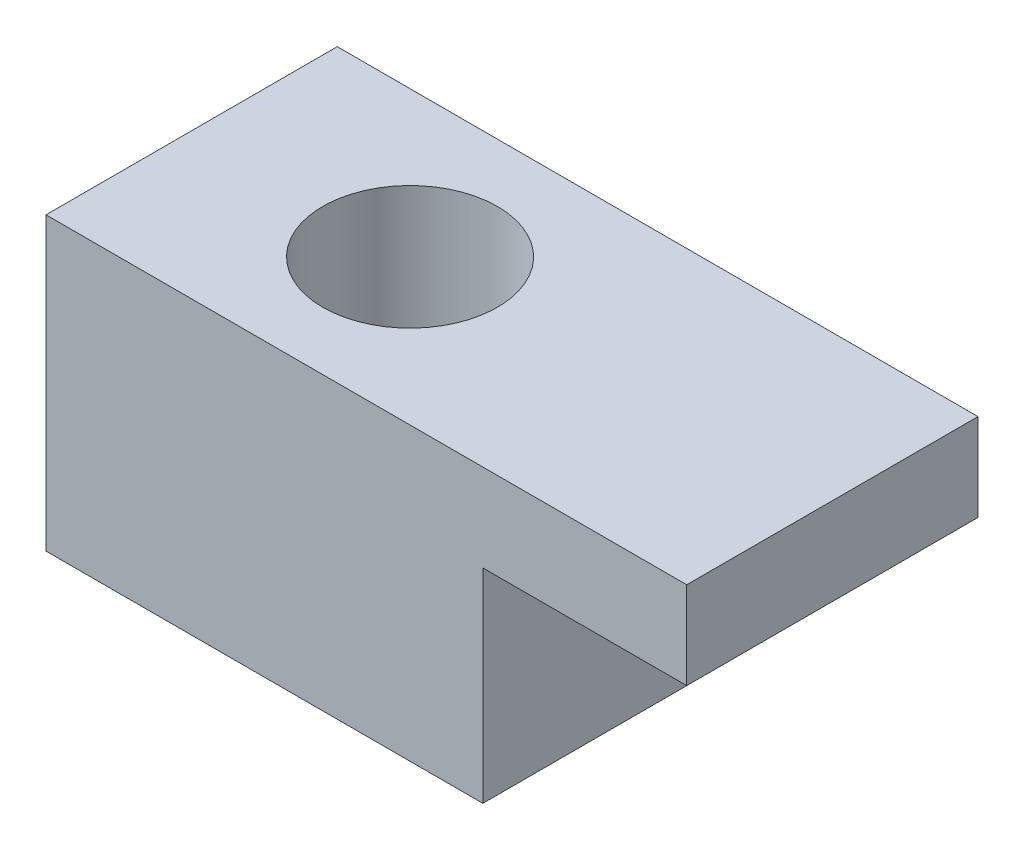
from build123d import *

# Parameters (mm, degrees)
EXTRUDE1_DEPTH     = 10
SKETCH2_R          = 3
CUT_EXTRUDE1_DEPTH = 27.153393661


with BuildPart() as part:
    # Sketch1 → Extrude1 (new body)
    with BuildSketch(Plane.XY):
        Polygon((15, 7), (22, 7), (22, 10), (0, 10), (0, 0), (15, 0), align=None)
    extrude(amount=EXTRUDE1_DEPTH)

    # Sketch2 → Cut-Extrude1 (cut, through all)
    with BuildSketch(Plane(origin=(0, 10, 0), x_dir=(-1, 0, 0), z_dir=(0, 1, 0))):
        with Locations(Location((-7.5, 5, 0), (0, 0, 90))):
            Circle(SKETCH2_R)
    extrude(amount=-CUT_EXTRUDE1_DEPTH, mode=Mode.SUBTRACT)


solid = part.part
